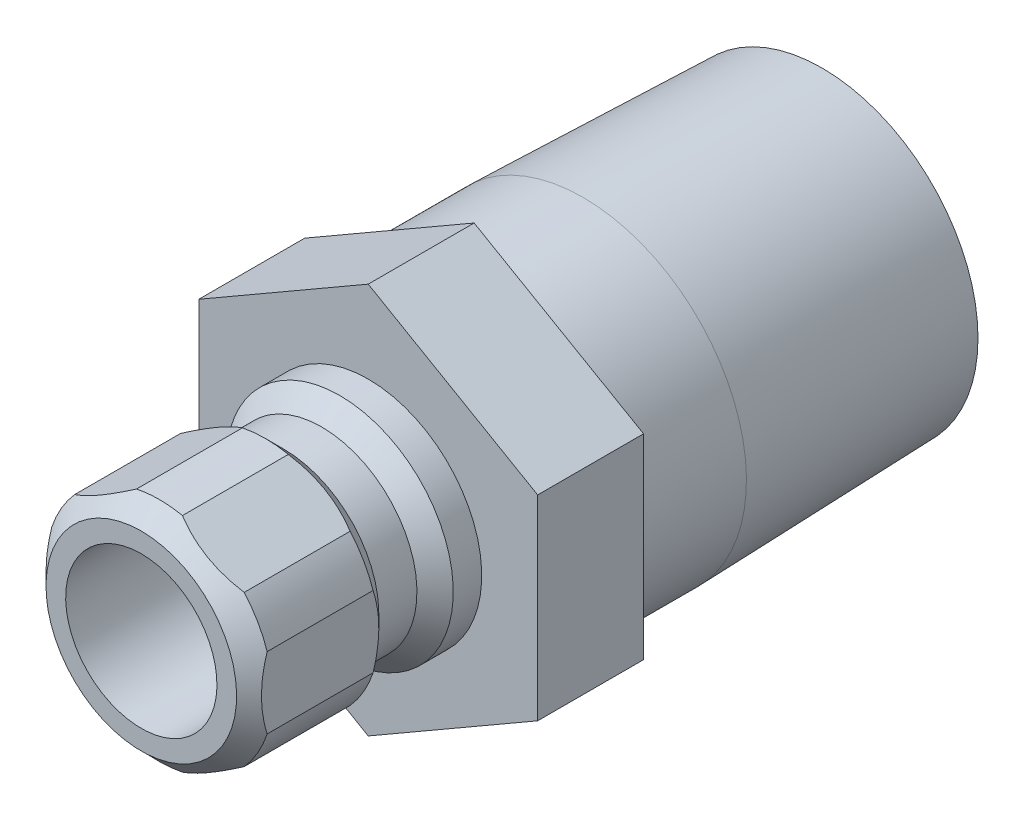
from build123d import *

# Parameters (mm, degrees)
SKETCH2_R           = 3.175
BOSS_EXTRUDE1_DEPTH = 4.445
CUT_EXTRUDE1_START  = 3.556
SKETCH3_OUTSIDE_W   = 23.404
SKETCH3_OUTSIDE_H   = 25.604
CUT_EXTRUDE1_DEPTH  = 19.373974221


with BuildPart() as part:
    # Sketch1 → Revolve1 (revolve)
    with BuildSketch(Plane(origin=(0, 0, 0), x_dir=(0, 0, -1), z_dir=(1, 0, 0))):
        Polygon((-9.525, 3.175), (-9.525, 4.0005), (-8.763, 4.7625), (-4.318, 4.7625), (-3.556, 4.0005), (-1.9558, 4.0005), (-1.1938, 4.7625), (0, 4.7625), (0, 6.858), (9.017, 6.858), (19.05, 6.544470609), (19.05, 4.6228), (0.127, 4.6228), (0.127, 3.175), align=None)
    revolve(axis=Axis((0, 0, 0), (0, 0, 1)))

    # Sketch2 → Boss-Extrude1 (add)
    with BuildSketch(Plane.XY):
        Polygon((-7.112, 4.106115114), (-7.112, -4.106115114), (0, -8.212230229), (7.112, -4.106115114), (7.112, 4.106115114), (0, 8.212230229), align=None)
        with Locations(Location((0, 0, 0), (0, 0, 90))):
            Circle(SKETCH2_R, mode=Mode.SUBTRACT)
    extrude(amount=-BOSS_EXTRUDE1_DEPTH)

    # Sketch3 outside → Cut-Extrude1 (cut, through all)
    with BuildSketch(Plane.XY.offset(CUT_EXTRUDE1_START)):
        Rectangle(SKETCH3_OUTSIDE_W, SKETCH3_OUTSIDE_H)
        Polygon((-4.5212, 2.610316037), (-4.5212, -2.610316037), (0, -5.220632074), (4.5212, -2.610316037), (4.5212, 2.610316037), (0, 5.220632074), align=None, mode=Mode.SUBTRACT)
    extrude(amount=CUT_EXTRUDE1_DEPTH, mode=Mode.SUBTRACT)


solid = part.part
